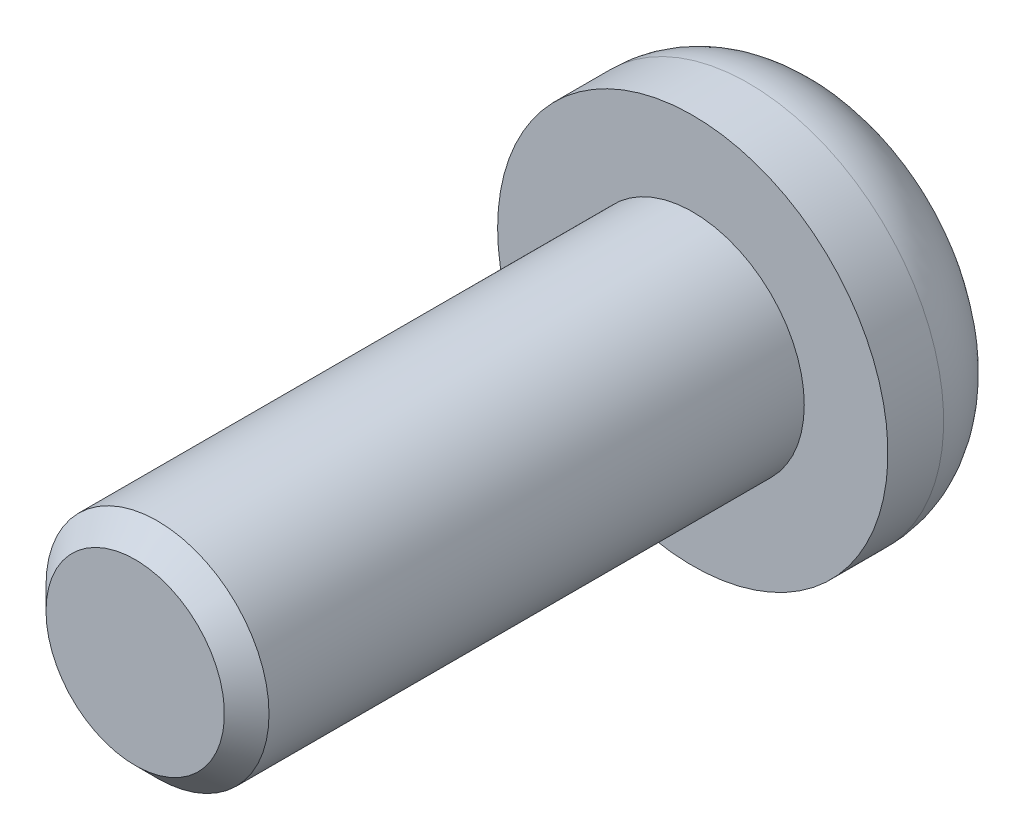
from build123d import *

# Parameters (mm, degrees)
ENLEV_MAT_EXTRU1_DEPTH = 5
ESQUISSE3_W            = 2
ESQUISSE3_H            = 10
CHANFREIN1_SIZE        = 0.4


with BuildPart() as part:
    # Esquisse1 → Base-R_volution (revolve)
    with BuildSketch(Plane(origin=(0, 0, 0), x_dir=(1, 0, 0), z_dir=(0, 1, 0)), mode=Mode.PRIVATE) as base_r_volution_sk:
        with BuildLine():
            Line((0, 0), (3.5, 0))
            Line((3.5, 0), (3.5, 1))
            ThreePointArc((3.5, 1), (3.060660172, 2.060660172), (2, 2.5))
            Line((2, 2.5), (0, 2.5))
            Line((0, 2.5), (0, 0))
        make_face()
    revolve(base_r_volution_sk.sketch.rotate(Axis((0, 0, 0), (0, 0, -1)), 180), axis=Axis((0, 0, 0), (0, 0, -1)))

    # Esquisse2 → enlev-mat-Extru1 (cut)
    with BuildSketch(Plane.XY.offset(-2.5)):
        Polygon((1.5, -0.866025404), (1.5, 0.866025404), (0, 1.732050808), (-1.5, 0.866025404), (-1.5, -0.866025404), (0, -1.732050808), align=None)
    extrude(amount=ENLEV_MAT_EXTRU1_DEPTH, mode=Mode.SUBTRACT)

    # Esquisse3 → Boss.-R_vol.1 (revolve)
    with BuildSketch(Plane(origin=(0, 0, 0), x_dir=(1, 0, 0), z_dir=(0, 1, 0))):
        with Locations((1, -5)):
            Rectangle(ESQUISSE3_W, ESQUISSE3_H)
    revolve(axis=Axis((0, 0, 0), (0, 0, 1)))

    # Chanfrein1
    chanfrein1_edges = [part.edges().sort_by_distance(p)[0] for p in [
        (-2, 0, 10),
    ]]
    chamfer(chanfrein1_edges, length=CHANFREIN1_SIZE)


solid = part.part
